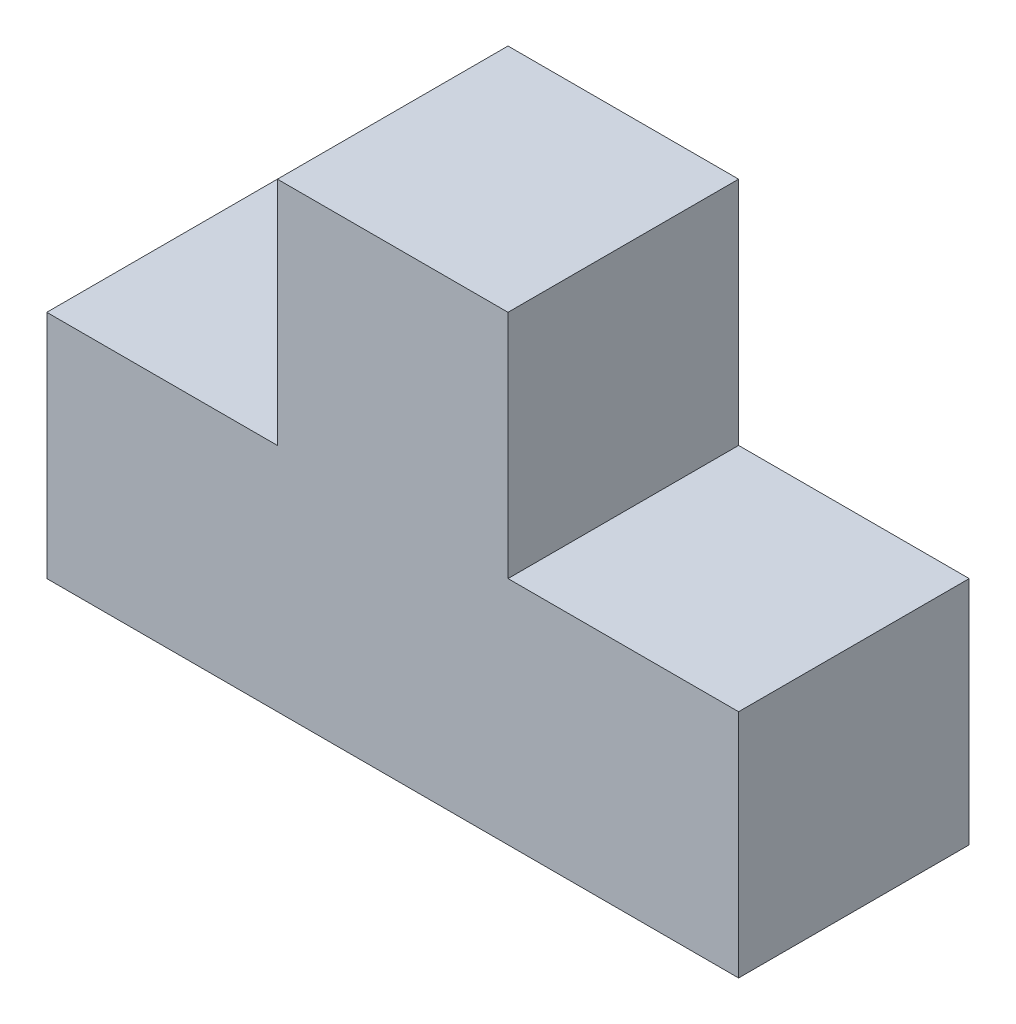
ISO-10303-21;
HEADER;
FILE_DESCRIPTION(('STEP AP214'),'2;1');
FILE_NAME('part.step','',(''),(''),'','','');
FILE_SCHEMA(('AUTOMOTIVE_DESIGN { 1 0 10303 214 1 1 1 1 }'));
ENDSEC;
DATA;
#1=APPLICATION_CONTEXT('core data for automotive mechanical design processes');
#2=APPLICATION_PROTOCOL_DEFINITION('international standard','automotive_design',2000,#1);
#3=PRODUCT_CONTEXT('',#1,'mechanical');
#4=PRODUCT('Part','Part','',(#3));
#5=PRODUCT_RELATED_PRODUCT_CATEGORY('part','',(#4));
#6=PRODUCT_DEFINITION_FORMATION('','',#4);
#7=PRODUCT_DEFINITION_CONTEXT('part definition',#1,'design');
#8=PRODUCT_DEFINITION('design','',#6,#7);
#9=PRODUCT_DEFINITION_SHAPE('','',#8);
#10=(LENGTH_UNIT() NAMED_UNIT(*) SI_UNIT(.MILLI.,.METRE.));
#11=(NAMED_UNIT(*) PLANE_ANGLE_UNIT() SI_UNIT($,.RADIAN.));
#12=(NAMED_UNIT(*) SI_UNIT($,.STERADIAN.) SOLID_ANGLE_UNIT());
#13=UNCERTAINTY_MEASURE_WITH_UNIT(LENGTH_MEASURE(1.E-05),#10,'distance_accuracy_value','');
#14=(GEOMETRIC_REPRESENTATION_CONTEXT(3) GLOBAL_UNCERTAINTY_ASSIGNED_CONTEXT((#13)) GLOBAL_UNIT_ASSIGNED_CONTEXT((#10,
#11,#12)) REPRESENTATION_CONTEXT('',''));
#15=CARTESIAN_POINT('',(0.,0.,0.));
#16=DIRECTION('',(0.,0.,1.));
#17=DIRECTION('',(1.,0.,0.));
#18=AXIS2_PLACEMENT_3D('',#15,#16,#17);
#19=CARTESIAN_POINT('',(0.292308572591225,0.,25.4));
#20=DIRECTION('',(0.,-1.,0.));
#21=DIRECTION('',(1.,0.,0.));
#22=AXIS2_PLACEMENT_3D('',#19,#20,#21);
#23=PLANE('',#22);
#24=DIRECTION('',(-1.,0.,0.));
#25=VECTOR('',#24,1.);
#26=CARTESIAN_POINT('',(0.292308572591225,0.,-25.4));
#27=LINE('',#26,#25);
#28=CARTESIAN_POINT('',(76.2,0.,-25.4));
#29=VERTEX_POINT('',#28);
#30=CARTESIAN_POINT('',(-76.2,0.,-25.4));
#31=VERTEX_POINT('',#30);
#32=EDGE_CURVE('E126',#29,#31,#27,.T.);
#33=ORIENTED_EDGE('',*,*,#32,.F.);
#34=DIRECTION('',(0.,0.,-1.));
#35=VECTOR('',#34,1.);
#36=CARTESIAN_POINT('',(76.2,0.,25.4));
#37=LINE('',#36,#35);
#38=CARTESIAN_POINT('',(76.2,0.,25.4));
#39=VERTEX_POINT('',#38);
#40=EDGE_CURVE('E11',#39,#29,#37,.T.);
#41=ORIENTED_EDGE('',*,*,#40,.F.);
#42=DIRECTION('',(-1.,0.,0.));
#43=VECTOR('',#42,1.);
#44=CARTESIAN_POINT('',(0.292308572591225,0.,25.4));
#45=LINE('',#44,#43);
#46=CARTESIAN_POINT('',(-76.2,0.,25.4));
#47=VERTEX_POINT('',#46);
#48=EDGE_CURVE('E146',#39,#47,#45,.T.);
#49=ORIENTED_EDGE('',*,*,#48,.T.);
#50=DIRECTION('',(0.,0.,-1.));
#51=VECTOR('',#50,1.);
#52=CARTESIAN_POINT('',(-76.2,0.,25.4));
#53=LINE('',#52,#51);
#54=EDGE_CURVE('E47',#47,#31,#53,.T.);
#55=ORIENTED_EDGE('',*,*,#54,.T.);
#56=EDGE_LOOP('',(#33,#41,#49,#55));
#57=FACE_BOUND('',#56,.T.);
#58=ADVANCED_FACE('F31',(#57),#23,.T.);
#59=CARTESIAN_POINT('',(76.2,-125.857163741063,25.4));
#60=DIRECTION('',(-1.,0.,0.));
#61=DIRECTION('',(0.,-1.,0.));
#62=AXIS2_PLACEMENT_3D('',#59,#60,#61);
#63=PLANE('',#62);
#64=DIRECTION('',(0.,1.,0.));
#65=VECTOR('',#64,1.);
#66=CARTESIAN_POINT('',(76.2,-125.857163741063,-25.4));
#67=LINE('',#66,#65);
#68=CARTESIAN_POINT('',(76.2,50.8,-25.4));
#69=VERTEX_POINT('',#68);
#70=EDGE_CURVE('E128',#29,#69,#67,.T.);
#71=ORIENTED_EDGE('',*,*,#70,.T.);
#72=DIRECTION('',(0.,0.,-1.));
#73=VECTOR('',#72,1.);
#74=CARTESIAN_POINT('',(76.2,50.8,25.4));
#75=LINE('',#74,#73);
#76=CARTESIAN_POINT('',(76.2,50.8,25.4));
#77=VERTEX_POINT('',#76);
#78=EDGE_CURVE('E39',#77,#69,#75,.T.);
#79=ORIENTED_EDGE('',*,*,#78,.F.);
#80=DIRECTION('',(0.,1.,0.));
#81=VECTOR('',#80,1.);
#82=CARTESIAN_POINT('',(76.2,-125.857163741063,25.4));
#83=LINE('',#82,#81);
#84=EDGE_CURVE('E171',#39,#77,#83,.T.);
#85=ORIENTED_EDGE('',*,*,#84,.F.);
#86=ORIENTED_EDGE('',*,*,#40,.T.);
#87=EDGE_LOOP('',(#71,#79,#85,#86));
#88=FACE_BOUND('',#87,.T.);
#89=ADVANCED_FACE('F162',(#88),#63,.F.);
#90=CARTESIAN_POINT('',(0.292308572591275,50.8,25.4));
#91=DIRECTION('',(0.,1.,0.));
#92=DIRECTION('',(-1.,0.,0.));
#93=AXIS2_PLACEMENT_3D('',#90,#91,#92);
#94=PLANE('',#93);
#95=DIRECTION('',(1.,0.,0.));
#96=VECTOR('',#95,1.);
#97=CARTESIAN_POINT('',(0.292308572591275,50.8,-25.4));
#98=LINE('',#97,#96);
#99=CARTESIAN_POINT('',(25.4,50.8,-25.4));
#100=VERTEX_POINT('',#99);
#101=EDGE_CURVE('E131',#100,#69,#98,.T.);
#102=ORIENTED_EDGE('',*,*,#101,.F.);
#103=DIRECTION('',(0.,0.,-1.));
#104=VECTOR('',#103,1.);
#105=CARTESIAN_POINT('',(25.4,50.8,25.4));
#106=LINE('',#105,#104);
#107=CARTESIAN_POINT('',(25.4,50.8,25.4));
#108=VERTEX_POINT('',#107);
#109=EDGE_CURVE('E152',#108,#100,#106,.T.);
#110=ORIENTED_EDGE('',*,*,#109,.F.);
#111=DIRECTION('',(1.,0.,0.));
#112=VECTOR('',#111,1.);
#113=CARTESIAN_POINT('',(0.292308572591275,50.8,25.4));
#114=LINE('',#113,#112);
#115=EDGE_CURVE('E159',#108,#77,#114,.T.);
#116=ORIENTED_EDGE('',*,*,#115,.T.);
#117=ORIENTED_EDGE('',*,*,#78,.T.);
#118=EDGE_LOOP('',(#102,#110,#116,#117));
#119=FACE_BOUND('',#118,.T.);
#120=ADVANCED_FACE('F157',(#119),#94,.T.);
#121=CARTESIAN_POINT('',(25.4,-125.857163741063,25.4));
#122=DIRECTION('',(-1.,0.,0.));
#123=DIRECTION('',(0.,-1.,0.));
#124=AXIS2_PLACEMENT_3D('',#121,#122,#123);
#125=PLANE('',#124);
#126=DIRECTION('',(0.,1.,0.));
#127=VECTOR('',#126,1.);
#128=CARTESIAN_POINT('',(25.4,-125.857163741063,-25.4));
#129=LINE('',#128,#127);
#130=CARTESIAN_POINT('',(25.4,101.6,-25.4));
#131=VERTEX_POINT('',#130);
#132=EDGE_CURVE('E134',#100,#131,#129,.T.);
#133=ORIENTED_EDGE('',*,*,#132,.T.);
#134=DIRECTION('',(0.,0.,-1.));
#135=VECTOR('',#134,1.);
#136=CARTESIAN_POINT('',(25.4,101.6,25.4));
#137=LINE('',#136,#135);
#138=CARTESIAN_POINT('',(25.4,101.6,25.4));
#139=VERTEX_POINT('',#138);
#140=EDGE_CURVE('E150',#139,#131,#137,.T.);
#141=ORIENTED_EDGE('',*,*,#140,.F.);
#142=DIRECTION('',(0.,1.,0.));
#143=VECTOR('',#142,1.);
#144=CARTESIAN_POINT('',(25.4,-125.857163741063,25.4));
#145=LINE('',#144,#143);
#146=EDGE_CURVE('E121',#108,#139,#145,.T.);
#147=ORIENTED_EDGE('',*,*,#146,.F.);
#148=ORIENTED_EDGE('',*,*,#109,.T.);
#149=EDGE_LOOP('',(#133,#141,#147,#148));
#150=FACE_BOUND('',#149,.T.);
#151=ADVANCED_FACE('F169',(#150),#125,.F.);
#152=CARTESIAN_POINT('',(0.292308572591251,101.6,25.4));
#153=DIRECTION('',(0.,1.,0.));
#154=DIRECTION('',(0.,0.,1.));
#155=AXIS2_PLACEMENT_3D('',#152,#153,#154);
#156=PLANE('',#155);
#157=DIRECTION('',(1.,0.,0.));
#158=VECTOR('',#157,1.);
#159=CARTESIAN_POINT('',(0.292308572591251,101.6,-25.4));
#160=LINE('',#159,#158);
#161=CARTESIAN_POINT('',(-25.4,101.6,-25.4));
#162=VERTEX_POINT('',#161);
#163=EDGE_CURVE('E137',#162,#131,#160,.T.);
#164=ORIENTED_EDGE('',*,*,#163,.F.);
#165=DIRECTION('',(0.,0.,-1.));
#166=VECTOR('',#165,1.);
#167=CARTESIAN_POINT('',(-25.4,101.6,25.4));
#168=LINE('',#167,#166);
#169=CARTESIAN_POINT('',(-25.4,101.6,25.4));
#170=VERTEX_POINT('',#169);
#171=EDGE_CURVE('E107',#170,#162,#168,.T.);
#172=ORIENTED_EDGE('',*,*,#171,.F.);
#173=DIRECTION('',(1.,0.,0.));
#174=VECTOR('',#173,1.);
#175=CARTESIAN_POINT('',(0.292308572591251,101.6,25.4));
#176=LINE('',#175,#174);
#177=EDGE_CURVE('E119',#170,#139,#176,.T.);
#178=ORIENTED_EDGE('',*,*,#177,.T.);
#179=ORIENTED_EDGE('',*,*,#140,.T.);
#180=EDGE_LOOP('',(#164,#172,#178,#179));
#181=FACE_BOUND('',#180,.T.);
#182=ADVANCED_FACE('F196',(#181),#156,.T.);
#183=CARTESIAN_POINT('',(-25.4,-125.857163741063,25.4));
#184=DIRECTION('',(-1.,0.,0.));
#185=DIRECTION('',(0.,0.,1.));
#186=AXIS2_PLACEMENT_3D('',#183,#184,#185);
#187=PLANE('',#186);
#188=DIRECTION('',(0.,1.,0.));
#189=VECTOR('',#188,1.);
#190=CARTESIAN_POINT('',(-25.4,-125.857163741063,-25.4));
#191=LINE('',#190,#189);
#192=CARTESIAN_POINT('',(-25.4,50.8,-25.4));
#193=VERTEX_POINT('',#192);
#194=EDGE_CURVE('E104',#193,#162,#191,.T.);
#195=ORIENTED_EDGE('',*,*,#194,.F.);
#196=DIRECTION('',(0.,0.,-1.));
#197=VECTOR('',#196,1.);
#198=CARTESIAN_POINT('',(-25.4,50.8,25.4));
#199=LINE('',#198,#197);
#200=CARTESIAN_POINT('',(-25.4,50.8,25.4));
#201=VERTEX_POINT('',#200);
#202=EDGE_CURVE('E98',#201,#193,#199,.T.);
#203=ORIENTED_EDGE('',*,*,#202,.F.);
#204=DIRECTION('',(0.,1.,0.));
#205=VECTOR('',#204,1.);
#206=CARTESIAN_POINT('',(-25.4,-125.857163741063,25.4));
#207=LINE('',#206,#205);
#208=EDGE_CURVE('E102',#201,#170,#207,.T.);
#209=ORIENTED_EDGE('',*,*,#208,.T.);
#210=ORIENTED_EDGE('',*,*,#171,.T.);
#211=EDGE_LOOP('',(#195,#203,#209,#210));
#212=FACE_BOUND('',#211,.T.);
#213=ADVANCED_FACE('F100',(#212),#187,.T.);
#214=CARTESIAN_POINT('',(0.292308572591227,50.8,25.4));
#215=DIRECTION('',(0.,-1.,0.));
#216=DIRECTION('',(1.,0.,0.));
#217=AXIS2_PLACEMENT_3D('',#214,#215,#216);
#218=PLANE('',#217);
#219=DIRECTION('',(-1.,0.,0.));
#220=VECTOR('',#219,1.);
#221=CARTESIAN_POINT('',(0.292308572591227,50.8,-25.4));
#222=LINE('',#221,#220);
#223=CARTESIAN_POINT('',(-76.2,50.8,-25.4));
#224=VERTEX_POINT('',#223);
#225=EDGE_CURVE('E141',#193,#224,#222,.T.);
#226=ORIENTED_EDGE('',*,*,#225,.T.);
#227=DIRECTION('',(0.,0.,-1.));
#228=VECTOR('',#227,1.);
#229=CARTESIAN_POINT('',(-76.2,50.8,25.4));
#230=LINE('',#229,#228);
#231=CARTESIAN_POINT('',(-76.2,50.8,25.4));
#232=VERTEX_POINT('',#231);
#233=EDGE_CURVE('E73',#232,#224,#230,.T.);
#234=ORIENTED_EDGE('',*,*,#233,.F.);
#235=DIRECTION('',(-1.,0.,0.));
#236=VECTOR('',#235,1.);
#237=CARTESIAN_POINT('',(0.292308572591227,50.8,25.4));
#238=LINE('',#237,#236);
#239=EDGE_CURVE('E109',#201,#232,#238,.T.);
#240=ORIENTED_EDGE('',*,*,#239,.F.);
#241=ORIENTED_EDGE('',*,*,#202,.T.);
#242=EDGE_LOOP('',(#226,#234,#240,#241));
#243=FACE_BOUND('',#242,.T.);
#244=ADVANCED_FACE('F110',(#243),#218,.F.);
#245=CARTESIAN_POINT('',(-76.2,-125.857163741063,25.4));
#246=DIRECTION('',(-1.,0.,0.));
#247=DIRECTION('',(0.,-1.,0.));
#248=AXIS2_PLACEMENT_3D('',#245,#246,#247);
#249=PLANE('',#248);
#250=DIRECTION('',(0.,1.,0.));
#251=VECTOR('',#250,1.);
#252=CARTESIAN_POINT('',(-76.2,-125.857163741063,-25.4));
#253=LINE('',#252,#251);
#254=EDGE_CURVE('E143',#31,#224,#253,.T.);
#255=ORIENTED_EDGE('',*,*,#254,.F.);
#256=ORIENTED_EDGE('',*,*,#54,.F.);
#257=DIRECTION('',(0.,1.,0.));
#258=VECTOR('',#257,1.);
#259=CARTESIAN_POINT('',(-76.2,-125.857163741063,25.4));
#260=LINE('',#259,#258);
#261=EDGE_CURVE('E113',#47,#232,#260,.T.);
#262=ORIENTED_EDGE('',*,*,#261,.T.);
#263=ORIENTED_EDGE('',*,*,#233,.T.);
#264=EDGE_LOOP('',(#255,#256,#262,#263));
#265=FACE_BOUND('',#264,.T.);
#266=ADVANCED_FACE('F175',(#265),#249,.T.);
#267=CARTESIAN_POINT('',(0.292308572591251,-125.857163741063,25.4));
#268=DIRECTION('',(0.,0.,1.));
#269=DIRECTION('',(1.,0.,0.));
#270=AXIS2_PLACEMENT_3D('',#267,#268,#269);
#271=PLANE('',#270);
#272=ORIENTED_EDGE('',*,*,#48,.F.);
#273=ORIENTED_EDGE('',*,*,#84,.T.);
#274=ORIENTED_EDGE('',*,*,#115,.F.);
#275=ORIENTED_EDGE('',*,*,#146,.T.);
#276=ORIENTED_EDGE('',*,*,#177,.F.);
#277=ORIENTED_EDGE('',*,*,#208,.F.);
#278=ORIENTED_EDGE('',*,*,#239,.T.);
#279=ORIENTED_EDGE('',*,*,#261,.F.);
#280=EDGE_LOOP('',(#272,#273,#274,#275,#276,#277,#278,#279));
#281=FACE_BOUND('',#280,.T.);
#282=ADVANCED_FACE('F117',(#281),#271,.T.);
#283=CARTESIAN_POINT('',(0.292308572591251,-125.857163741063,-25.4));
#284=DIRECTION('',(0.,0.,1.));
#285=DIRECTION('',(1.,0.,0.));
#286=AXIS2_PLACEMENT_3D('',#283,#284,#285);
#287=PLANE('',#286);
#288=ORIENTED_EDGE('',*,*,#32,.T.);
#289=ORIENTED_EDGE('',*,*,#254,.T.);
#290=ORIENTED_EDGE('',*,*,#225,.F.);
#291=ORIENTED_EDGE('',*,*,#194,.T.);
#292=ORIENTED_EDGE('',*,*,#163,.T.);
#293=ORIENTED_EDGE('',*,*,#132,.F.);
#294=ORIENTED_EDGE('',*,*,#101,.T.);
#295=ORIENTED_EDGE('',*,*,#70,.F.);
#296=EDGE_LOOP('',(#288,#289,#290,#291,#292,#293,#294,#295));
#297=FACE_BOUND('',#296,.T.);
#298=ADVANCED_FACE('F165',(#297),#287,.F.);
#299=CLOSED_SHELL('',(#58,#89,#120,#151,#182,#213,#244,#266,#282,#298));
#300=MANIFOLD_SOLID_BREP('B2',#299);
#301=ADVANCED_BREP_SHAPE_REPRESENTATION('',(#18,#300),#14);
#302=SHAPE_DEFINITION_REPRESENTATION(#9,#301);
ENDSEC;
END-ISO-10303-21;
